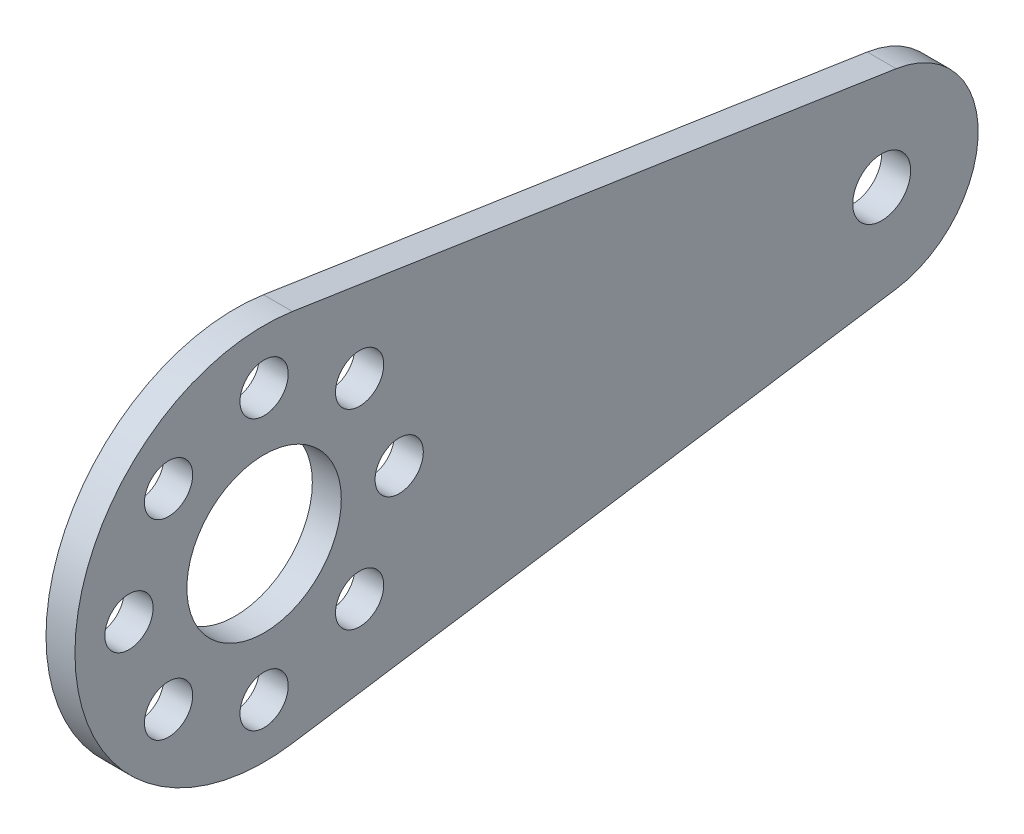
ISO-10303-21;
HEADER;
FILE_DESCRIPTION(('STEP AP214'),'2;1');
FILE_NAME('part.step','',(''),(''),'','','');
FILE_SCHEMA(('AUTOMOTIVE_DESIGN { 1 0 10303 214 1 1 1 1 }'));
ENDSEC;
DATA;
#1=APPLICATION_CONTEXT('core data for automotive mechanical design processes');
#2=APPLICATION_PROTOCOL_DEFINITION('international standard','automotive_design',2000,#1);
#3=PRODUCT_CONTEXT('',#1,'mechanical');
#4=PRODUCT('Part','Part','',(#3));
#5=PRODUCT_RELATED_PRODUCT_CATEGORY('part','',(#4));
#6=PRODUCT_DEFINITION_FORMATION('','',#4);
#7=PRODUCT_DEFINITION_CONTEXT('part definition',#1,'design');
#8=PRODUCT_DEFINITION('design','',#6,#7);
#9=PRODUCT_DEFINITION_SHAPE('','',#8);
#10=(LENGTH_UNIT() NAMED_UNIT(*) SI_UNIT(.MILLI.,.METRE.));
#11=(NAMED_UNIT(*) PLANE_ANGLE_UNIT() SI_UNIT($,.RADIAN.));
#12=(NAMED_UNIT(*) SI_UNIT($,.STERADIAN.) SOLID_ANGLE_UNIT());
#13=UNCERTAINTY_MEASURE_WITH_UNIT(LENGTH_MEASURE(1.E-05),#10,'distance_accuracy_value','');
#14=(GEOMETRIC_REPRESENTATION_CONTEXT(3) GLOBAL_UNCERTAINTY_ASSIGNED_CONTEXT((#13)) GLOBAL_UNIT_ASSIGNED_CONTEXT((#10,
#11,#12)) REPRESENTATION_CONTEXT('',''));
#15=CARTESIAN_POINT('',(0.,0.,0.));
#16=DIRECTION('',(0.,0.,1.));
#17=DIRECTION('',(1.,0.,0.));
#18=AXIS2_PLACEMENT_3D('',#15,#16,#17);
#19=CARTESIAN_POINT('',(-1.5,0.,0.));
#20=DIRECTION('',(1.,0.,0.));
#21=DIRECTION('',(0.,0.,-1.));
#22=AXIS2_PLACEMENT_3D('',#19,#20,#21);
#23=CYLINDRICAL_SURFACE('',#22,9.8);
#24=CARTESIAN_POINT('',(0.,0.,0.));
#25=DIRECTION('',(1.,0.,0.));
#26=DIRECTION('',(0.,0.,-1.));
#27=AXIS2_PLACEMENT_3D('',#24,#25,#26);
#28=CIRCLE('',#27,9.8);
#29=CARTESIAN_POINT('',(0.,9.68912276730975,-1.47));
#30=VERTEX_POINT('',#29);
#31=CARTESIAN_POINT('',(0.,-9.68912276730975,-1.47));
#32=VERTEX_POINT('',#31);
#33=EDGE_CURVE('E115',#30,#32,#28,.T.);
#34=ORIENTED_EDGE('',*,*,#33,.F.);
#35=DIRECTION('',(1.,0.,0.));
#36=VECTOR('',#35,1.);
#37=CARTESIAN_POINT('',(-1.5,9.68912276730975,-1.47));
#38=LINE('',#37,#36);
#39=CARTESIAN_POINT('',(-1.5,9.68912276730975,-1.47));
#40=VERTEX_POINT('',#39);
#41=EDGE_CURVE('E11',#40,#30,#38,.T.);
#42=ORIENTED_EDGE('',*,*,#41,.F.);
#43=CARTESIAN_POINT('',(-1.5,0.,0.));
#44=DIRECTION('',(1.,0.,0.));
#45=DIRECTION('',(0.,0.,-1.));
#46=AXIS2_PLACEMENT_3D('',#43,#44,#45);
#47=CIRCLE('',#46,9.8);
#48=CARTESIAN_POINT('',(-1.5,-9.68912276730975,-1.47));
#49=VERTEX_POINT('',#48);
#50=EDGE_CURVE('E106',#40,#49,#47,.T.);
#51=ORIENTED_EDGE('',*,*,#50,.T.);
#52=DIRECTION('',(1.,0.,0.));
#53=VECTOR('',#52,1.);
#54=CARTESIAN_POINT('',(-1.5,-9.68912276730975,-1.47));
#55=LINE('',#54,#53);
#56=EDGE_CURVE('E47',#49,#32,#55,.T.);
#57=ORIENTED_EDGE('',*,*,#56,.T.);
#58=EDGE_LOOP('',(#34,#42,#51,#57));
#59=FACE_BOUND('',#58,.T.);
#60=ADVANCED_FACE('F44',(#59),#23,.T.);
#61=CARTESIAN_POINT('',(-1.5,9.68912276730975,-1.47));
#62=DIRECTION('',(0.,0.988685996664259,-0.15));
#63=DIRECTION('',(0.,0.15,0.988685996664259));
#64=AXIS2_PLACEMENT_3D('',#61,#62,#63);
#65=PLANE('',#64);
#66=DIRECTION('',(0.,0.15,0.988685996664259));
#67=VECTOR('',#66,1.);
#68=CARTESIAN_POINT('',(0.,9.68912276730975,-1.47));
#69=LINE('',#68,#67);
#70=CARTESIAN_POINT('',(0.,4.9434299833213,-32.75));
#71=VERTEX_POINT('',#70);
#72=EDGE_CURVE('E109',#71,#30,#69,.T.);
#73=ORIENTED_EDGE('',*,*,#72,.F.);
#74=DIRECTION('',(1.,0.,0.));
#75=VECTOR('',#74,1.);
#76=CARTESIAN_POINT('',(-1.5,4.9434299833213,-32.75));
#77=LINE('',#76,#75);
#78=CARTESIAN_POINT('',(-1.5,4.9434299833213,-32.75));
#79=VERTEX_POINT('',#78);
#80=EDGE_CURVE('E54',#79,#71,#77,.T.);
#81=ORIENTED_EDGE('',*,*,#80,.F.);
#82=DIRECTION('',(0.,0.15,0.988685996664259));
#83=VECTOR('',#82,1.);
#84=CARTESIAN_POINT('',(-1.5,9.68912276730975,-1.47));
#85=LINE('',#84,#83);
#86=EDGE_CURVE('E101',#79,#40,#85,.T.);
#87=ORIENTED_EDGE('',*,*,#86,.T.);
#88=ORIENTED_EDGE('',*,*,#41,.T.);
#89=EDGE_LOOP('',(#73,#81,#87,#88));
#90=FACE_BOUND('',#89,.T.);
#91=ADVANCED_FACE('F132',(#90),#65,.T.);
#92=CARTESIAN_POINT('',(-1.5,0.,-32.));
#93=DIRECTION('',(1.,0.,0.));
#94=DIRECTION('',(0.,0.,-1.));
#95=AXIS2_PLACEMENT_3D('',#92,#93,#94);
#96=CYLINDRICAL_SURFACE('',#95,5.);
#97=CARTESIAN_POINT('',(0.,0.,-32.));
#98=DIRECTION('',(1.,0.,0.));
#99=DIRECTION('',(0.,0.,-1.));
#100=AXIS2_PLACEMENT_3D('',#97,#98,#99);
#101=CIRCLE('',#100,5.);
#102=CARTESIAN_POINT('',(0.,-4.9434299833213,-32.75));
#103=VERTEX_POINT('',#102);
#104=EDGE_CURVE('E95',#103,#71,#101,.T.);
#105=ORIENTED_EDGE('',*,*,#104,.F.);
#106=DIRECTION('',(1.,0.,0.));
#107=VECTOR('',#106,1.);
#108=CARTESIAN_POINT('',(-1.5,-4.9434299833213,-32.75));
#109=LINE('',#108,#107);
#110=CARTESIAN_POINT('',(-1.5,-4.9434299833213,-32.75));
#111=VERTEX_POINT('',#110);
#112=EDGE_CURVE('E90',#111,#103,#109,.T.);
#113=ORIENTED_EDGE('',*,*,#112,.F.);
#114=CARTESIAN_POINT('',(-1.5,0.,-32.));
#115=DIRECTION('',(1.,0.,0.));
#116=DIRECTION('',(0.,0.,-1.));
#117=AXIS2_PLACEMENT_3D('',#114,#115,#116);
#118=CIRCLE('',#117,5.);
#119=EDGE_CURVE('E93',#111,#79,#118,.T.);
#120=ORIENTED_EDGE('',*,*,#119,.T.);
#121=ORIENTED_EDGE('',*,*,#80,.T.);
#122=EDGE_LOOP('',(#105,#113,#120,#121));
#123=FACE_BOUND('',#122,.T.);
#124=ADVANCED_FACE('F92',(#123),#96,.T.);
#125=CARTESIAN_POINT('',(-1.5,-9.68912276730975,-1.47));
#126=DIRECTION('',(0.,-0.988685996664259,-0.15));
#127=DIRECTION('',(0.,0.15,-0.988685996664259));
#128=AXIS2_PLACEMENT_3D('',#125,#126,#127);
#129=PLANE('',#128);
#130=DIRECTION('',(0.,0.15,-0.988685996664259));
#131=VECTOR('',#130,1.);
#132=CARTESIAN_POINT('',(0.,-9.68912276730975,-1.47));
#133=LINE('',#132,#131);
#134=EDGE_CURVE('E119',#32,#103,#133,.T.);
#135=ORIENTED_EDGE('',*,*,#134,.F.);
#136=ORIENTED_EDGE('',*,*,#56,.F.);
#137=DIRECTION('',(0.,0.15,-0.988685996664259));
#138=VECTOR('',#137,1.);
#139=CARTESIAN_POINT('',(-1.5,-9.68912276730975,-1.47));
#140=LINE('',#139,#138);
#141=EDGE_CURVE('E100',#49,#111,#140,.T.);
#142=ORIENTED_EDGE('',*,*,#141,.T.);
#143=ORIENTED_EDGE('',*,*,#112,.T.);
#144=EDGE_LOOP('',(#135,#136,#142,#143));
#145=FACE_BOUND('',#144,.T.);
#146=ADVANCED_FACE('F104',(#145),#129,.T.);
#147=CARTESIAN_POINT('',(-1.5,0.,0.));
#148=DIRECTION('',(1.,0.,0.));
#149=DIRECTION('',(0.,0.,-1.));
#150=AXIS2_PLACEMENT_3D('',#147,#148,#149);
#151=PLANE('',#150);
#152=CARTESIAN_POINT('',(-1.5,-4.94974746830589,-4.94974746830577));
#153=DIRECTION('',(1.,0.,0.));
#154=DIRECTION('',(0.,0.,-1.));
#155=AXIS2_PLACEMENT_3D('',#152,#153,#154);
#156=CIRCLE('',#155,1.25);
#157=CARTESIAN_POINT('',(-1.5,-4.94974746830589,-6.19974746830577));
#158=VERTEX_POINT('',#157);
#159=EDGE_CURVE('E197',#158,#158,#156,.T.);
#160=ORIENTED_EDGE('',*,*,#159,.T.);
#161=EDGE_LOOP('',(#160));
#162=FACE_BOUND('',#161,.T.);
#163=CARTESIAN_POINT('',(-1.5,0.,-7.));
#164=DIRECTION('',(1.,0.,0.));
#165=DIRECTION('',(0.,0.,-1.));
#166=AXIS2_PLACEMENT_3D('',#163,#164,#165);
#167=CIRCLE('',#166,1.25);
#168=CARTESIAN_POINT('',(-1.5,0.,-8.25));
#169=VERTEX_POINT('',#168);
#170=EDGE_CURVE('E207',#169,#169,#167,.T.);
#171=ORIENTED_EDGE('',*,*,#170,.T.);
#172=EDGE_LOOP('',(#171));
#173=FACE_BOUND('',#172,.T.);
#174=CARTESIAN_POINT('',(-1.5,4.94974746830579,-4.94974746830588));
#175=DIRECTION('',(1.,0.,0.));
#176=DIRECTION('',(0.,0.,-1.));
#177=AXIS2_PLACEMENT_3D('',#174,#175,#176);
#178=CIRCLE('',#177,1.25);
#179=CARTESIAN_POINT('',(-1.5,4.94974746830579,-6.19974746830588));
#180=VERTEX_POINT('',#179);
#181=EDGE_CURVE('E215',#180,#180,#178,.T.);
#182=ORIENTED_EDGE('',*,*,#181,.T.);
#183=EDGE_LOOP('',(#182));
#184=FACE_BOUND('',#183,.T.);
#185=CARTESIAN_POINT('',(-1.5,7.,0.));
#186=DIRECTION('',(1.,0.,0.));
#187=DIRECTION('',(0.,0.,-1.));
#188=AXIS2_PLACEMENT_3D('',#185,#186,#187);
#189=CIRCLE('',#188,1.25);
#190=CARTESIAN_POINT('',(-1.5,7.,-1.25000000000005));
#191=VERTEX_POINT('',#190);
#192=EDGE_CURVE('E223',#191,#191,#189,.T.);
#193=ORIENTED_EDGE('',*,*,#192,.T.);
#194=EDGE_LOOP('',(#193));
#195=FACE_BOUND('',#194,.T.);
#196=CARTESIAN_POINT('',(-1.5,4.94974746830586,4.94974746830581));
#197=DIRECTION('',(1.,0.,0.));
#198=DIRECTION('',(0.,0.,-1.));
#199=AXIS2_PLACEMENT_3D('',#196,#197,#198);
#200=CIRCLE('',#199,1.25);
#201=CARTESIAN_POINT('',(-1.5,4.94974746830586,3.69974746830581));
#202=VERTEX_POINT('',#201);
#203=EDGE_CURVE('E231',#202,#202,#200,.T.);
#204=ORIENTED_EDGE('',*,*,#203,.T.);
#205=EDGE_LOOP('',(#204));
#206=FACE_BOUND('',#205,.T.);
#207=CARTESIAN_POINT('',(-1.5,0.,7.));
#208=DIRECTION('',(1.,0.,0.));
#209=DIRECTION('',(0.,0.,-1.));
#210=AXIS2_PLACEMENT_3D('',#207,#208,#209);
#211=CIRCLE('',#210,1.25);
#212=CARTESIAN_POINT('',(-1.5,0.,5.75));
#213=VERTEX_POINT('',#212);
#214=EDGE_CURVE('E239',#213,#213,#211,.T.);
#215=ORIENTED_EDGE('',*,*,#214,.T.);
#216=EDGE_LOOP('',(#215));
#217=FACE_BOUND('',#216,.T.);
#218=CARTESIAN_POINT('',(-1.5,-4.94974746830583,4.94974746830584));
#219=DIRECTION('',(1.,0.,0.));
#220=DIRECTION('',(0.,0.,-1.));
#221=AXIS2_PLACEMENT_3D('',#218,#219,#220);
#222=CIRCLE('',#221,1.25);
#223=CARTESIAN_POINT('',(-1.5,-4.94974746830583,3.69974746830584));
#224=VERTEX_POINT('',#223);
#225=EDGE_CURVE('E247',#224,#224,#222,.T.);
#226=ORIENTED_EDGE('',*,*,#225,.T.);
#227=EDGE_LOOP('',(#226));
#228=FACE_BOUND('',#227,.T.);
#229=CARTESIAN_POINT('',(-1.5,-7.,0.));
#230=DIRECTION('',(1.,0.,0.));
#231=DIRECTION('',(0.,0.,-1.));
#232=AXIS2_PLACEMENT_3D('',#229,#230,#231);
#233=CIRCLE('',#232,1.25);
#234=CARTESIAN_POINT('',(-1.5,-7.,-1.25));
#235=VERTEX_POINT('',#234);
#236=EDGE_CURVE('E255',#235,#235,#233,.T.);
#237=ORIENTED_EDGE('',*,*,#236,.T.);
#238=EDGE_LOOP('',(#237));
#239=FACE_BOUND('',#238,.T.);
#240=CARTESIAN_POINT('',(-1.5,0.,-32.));
#241=DIRECTION('',(1.,0.,0.));
#242=DIRECTION('',(0.,0.,-1.));
#243=AXIS2_PLACEMENT_3D('',#240,#241,#242);
#244=CIRCLE('',#243,1.5);
#245=CARTESIAN_POINT('',(-1.5,0.,-33.5));
#246=VERTEX_POINT('',#245);
#247=EDGE_CURVE('E263',#246,#246,#244,.T.);
#248=ORIENTED_EDGE('',*,*,#247,.T.);
#249=EDGE_LOOP('',(#248));
#250=FACE_BOUND('',#249,.T.);
#251=CARTESIAN_POINT('',(-1.5,0.,0.));
#252=DIRECTION('',(1.,0.,0.));
#253=DIRECTION('',(0.,0.,-1.));
#254=AXIS2_PLACEMENT_3D('',#251,#252,#253);
#255=CIRCLE('',#254,4.);
#256=CARTESIAN_POINT('',(-1.5,0.,-4.));
#257=VERTEX_POINT('',#256);
#258=EDGE_CURVE('E120',#257,#257,#255,.T.);
#259=ORIENTED_EDGE('',*,*,#258,.T.);
#260=EDGE_LOOP('',(#259));
#261=FACE_BOUND('',#260,.T.);
#262=ORIENTED_EDGE('',*,*,#50,.F.);
#263=ORIENTED_EDGE('',*,*,#86,.F.);
#264=ORIENTED_EDGE('',*,*,#119,.F.);
#265=ORIENTED_EDGE('',*,*,#141,.F.);
#266=EDGE_LOOP('',(#262,#263,#264,#265));
#267=FACE_BOUND('',#266,.T.);
#268=ADVANCED_FACE('F99',(#162,#173,#184,#195,#206,#217,#228,#239,#250,#261,#267),#151,.F.);
#269=CARTESIAN_POINT('',(0.,0.,0.));
#270=DIRECTION('',(1.,0.,0.));
#271=DIRECTION('',(0.,0.,-1.));
#272=AXIS2_PLACEMENT_3D('',#269,#270,#271);
#273=PLANE('',#272);
#274=CARTESIAN_POINT('',(0.,-4.94974746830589,-4.94974746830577));
#275=DIRECTION('',(1.,0.,0.));
#276=DIRECTION('',(0.,0.,-1.));
#277=AXIS2_PLACEMENT_3D('',#274,#275,#276);
#278=CIRCLE('',#277,1.25);
#279=CARTESIAN_POINT('',(0.,-4.94974746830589,-6.19974746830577));
#280=VERTEX_POINT('',#279);
#281=EDGE_CURVE('E200',#280,#280,#278,.T.);
#282=ORIENTED_EDGE('',*,*,#281,.F.);
#283=EDGE_LOOP('',(#282));
#284=FACE_BOUND('',#283,.T.);
#285=CARTESIAN_POINT('',(0.,0.,-7.));
#286=DIRECTION('',(1.,0.,0.));
#287=DIRECTION('',(0.,0.,-1.));
#288=AXIS2_PLACEMENT_3D('',#285,#286,#287);
#289=CIRCLE('',#288,1.25);
#290=CARTESIAN_POINT('',(0.,0.,-8.25));
#291=VERTEX_POINT('',#290);
#292=EDGE_CURVE('E204',#291,#291,#289,.T.);
#293=ORIENTED_EDGE('',*,*,#292,.F.);
#294=EDGE_LOOP('',(#293));
#295=FACE_BOUND('',#294,.T.);
#296=CARTESIAN_POINT('',(0.,4.94974746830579,-4.94974746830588));
#297=DIRECTION('',(1.,0.,0.));
#298=DIRECTION('',(0.,0.,-1.));
#299=AXIS2_PLACEMENT_3D('',#296,#297,#298);
#300=CIRCLE('',#299,1.25);
#301=CARTESIAN_POINT('',(0.,4.94974746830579,-6.19974746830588));
#302=VERTEX_POINT('',#301);
#303=EDGE_CURVE('E211',#302,#302,#300,.T.);
#304=ORIENTED_EDGE('',*,*,#303,.F.);
#305=EDGE_LOOP('',(#304));
#306=FACE_BOUND('',#305,.T.);
#307=CARTESIAN_POINT('',(0.,7.,0.));
#308=DIRECTION('',(1.,0.,0.));
#309=DIRECTION('',(0.,0.,-1.));
#310=AXIS2_PLACEMENT_3D('',#307,#308,#309);
#311=CIRCLE('',#310,1.25);
#312=CARTESIAN_POINT('',(0.,7.,-1.25000000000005));
#313=VERTEX_POINT('',#312);
#314=EDGE_CURVE('E219',#313,#313,#311,.T.);
#315=ORIENTED_EDGE('',*,*,#314,.F.);
#316=EDGE_LOOP('',(#315));
#317=FACE_BOUND('',#316,.T.);
#318=CARTESIAN_POINT('',(0.,4.94974746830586,4.94974746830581));
#319=DIRECTION('',(1.,0.,0.));
#320=DIRECTION('',(0.,0.,-1.));
#321=AXIS2_PLACEMENT_3D('',#318,#319,#320);
#322=CIRCLE('',#321,1.25);
#323=CARTESIAN_POINT('',(0.,4.94974746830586,3.69974746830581));
#324=VERTEX_POINT('',#323);
#325=EDGE_CURVE('E227',#324,#324,#322,.T.);
#326=ORIENTED_EDGE('',*,*,#325,.F.);
#327=EDGE_LOOP('',(#326));
#328=FACE_BOUND('',#327,.T.);
#329=CARTESIAN_POINT('',(0.,0.,7.));
#330=DIRECTION('',(1.,0.,0.));
#331=DIRECTION('',(0.,0.,-1.));
#332=AXIS2_PLACEMENT_3D('',#329,#330,#331);
#333=CIRCLE('',#332,1.25);
#334=CARTESIAN_POINT('',(0.,0.,5.75));
#335=VERTEX_POINT('',#334);
#336=EDGE_CURVE('E235',#335,#335,#333,.T.);
#337=ORIENTED_EDGE('',*,*,#336,.F.);
#338=EDGE_LOOP('',(#337));
#339=FACE_BOUND('',#338,.T.);
#340=CARTESIAN_POINT('',(0.,-4.94974746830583,4.94974746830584));
#341=DIRECTION('',(1.,0.,0.));
#342=DIRECTION('',(0.,0.,-1.));
#343=AXIS2_PLACEMENT_3D('',#340,#341,#342);
#344=CIRCLE('',#343,1.25);
#345=CARTESIAN_POINT('',(0.,-4.94974746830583,3.69974746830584));
#346=VERTEX_POINT('',#345);
#347=EDGE_CURVE('E243',#346,#346,#344,.T.);
#348=ORIENTED_EDGE('',*,*,#347,.F.);
#349=EDGE_LOOP('',(#348));
#350=FACE_BOUND('',#349,.T.);
#351=CARTESIAN_POINT('',(0.,-7.,0.));
#352=DIRECTION('',(1.,0.,0.));
#353=DIRECTION('',(0.,0.,-1.));
#354=AXIS2_PLACEMENT_3D('',#351,#352,#353);
#355=CIRCLE('',#354,1.25);
#356=CARTESIAN_POINT('',(0.,-7.,-1.25));
#357=VERTEX_POINT('',#356);
#358=EDGE_CURVE('E251',#357,#357,#355,.T.);
#359=ORIENTED_EDGE('',*,*,#358,.F.);
#360=EDGE_LOOP('',(#359));
#361=FACE_BOUND('',#360,.T.);
#362=CARTESIAN_POINT('',(0.,0.,-32.));
#363=DIRECTION('',(1.,0.,0.));
#364=DIRECTION('',(0.,0.,-1.));
#365=AXIS2_PLACEMENT_3D('',#362,#363,#364);
#366=CIRCLE('',#365,1.5);
#367=CARTESIAN_POINT('',(0.,0.,-33.5));
#368=VERTEX_POINT('',#367);
#369=EDGE_CURVE('E259',#368,#368,#366,.T.);
#370=ORIENTED_EDGE('',*,*,#369,.F.);
#371=EDGE_LOOP('',(#370));
#372=FACE_BOUND('',#371,.T.);
#373=CARTESIAN_POINT('',(0.,0.,0.));
#374=DIRECTION('',(1.,0.,0.));
#375=DIRECTION('',(0.,0.,-1.));
#376=AXIS2_PLACEMENT_3D('',#373,#374,#375);
#377=CIRCLE('',#376,4.);
#378=CARTESIAN_POINT('',(0.,0.,-4.));
#379=VERTEX_POINT('',#378);
#380=EDGE_CURVE('E267',#379,#379,#377,.T.);
#381=ORIENTED_EDGE('',*,*,#380,.F.);
#382=EDGE_LOOP('',(#381));
#383=FACE_BOUND('',#382,.T.);
#384=ORIENTED_EDGE('',*,*,#33,.T.);
#385=ORIENTED_EDGE('',*,*,#134,.T.);
#386=ORIENTED_EDGE('',*,*,#104,.T.);
#387=ORIENTED_EDGE('',*,*,#72,.T.);
#388=EDGE_LOOP('',(#384,#385,#386,#387));
#389=FACE_BOUND('',#388,.T.);
#390=ADVANCED_FACE('F131',(#284,#295,#306,#317,#328,#339,#350,#361,#372,#383,#389),#273,.T.);
#391=CARTESIAN_POINT('',(-1.5,0.,0.));
#392=DIRECTION('',(1.,0.,0.));
#393=DIRECTION('',(0.,0.,-1.));
#394=AXIS2_PLACEMENT_3D('',#391,#392,#393);
#395=CYLINDRICAL_SURFACE('',#394,4.);
#396=ORIENTED_EDGE('',*,*,#258,.F.);
#397=EDGE_LOOP('',(#396));
#398=FACE_BOUND('',#397,.T.);
#399=ORIENTED_EDGE('',*,*,#380,.T.);
#400=EDGE_LOOP('',(#399));
#401=FACE_BOUND('',#400,.T.);
#402=ADVANCED_FACE('F150',(#398,#401),#395,.F.);
#403=CARTESIAN_POINT('',(-1.5,0.,-32.));
#404=DIRECTION('',(1.,0.,0.));
#405=DIRECTION('',(0.,0.,-1.));
#406=AXIS2_PLACEMENT_3D('',#403,#404,#405);
#407=CYLINDRICAL_SURFACE('',#406,1.5);
#408=ORIENTED_EDGE('',*,*,#247,.F.);
#409=EDGE_LOOP('',(#408));
#410=FACE_BOUND('',#409,.T.);
#411=ORIENTED_EDGE('',*,*,#369,.T.);
#412=EDGE_LOOP('',(#411));
#413=FACE_BOUND('',#412,.T.);
#414=ADVANCED_FACE('F157',(#410,#413),#407,.F.);
#415=CARTESIAN_POINT('',(-1.5,-7.,0.));
#416=DIRECTION('',(1.,0.,0.));
#417=DIRECTION('',(0.,0.,-1.));
#418=AXIS2_PLACEMENT_3D('',#415,#416,#417);
#419=CYLINDRICAL_SURFACE('',#418,1.25);
#420=ORIENTED_EDGE('',*,*,#236,.F.);
#421=EDGE_LOOP('',(#420));
#422=FACE_BOUND('',#421,.T.);
#423=ORIENTED_EDGE('',*,*,#358,.T.);
#424=EDGE_LOOP('',(#423));
#425=FACE_BOUND('',#424,.T.);
#426=ADVANCED_FACE('F161',(#422,#425),#419,.F.);
#427=CARTESIAN_POINT('',(-1.5,-4.94974746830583,4.94974746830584));
#428=DIRECTION('',(1.,0.,0.));
#429=DIRECTION('',(0.,0.,-1.));
#430=AXIS2_PLACEMENT_3D('',#427,#428,#429);
#431=CYLINDRICAL_SURFACE('',#430,1.25);
#432=ORIENTED_EDGE('',*,*,#225,.F.);
#433=EDGE_LOOP('',(#432));
#434=FACE_BOUND('',#433,.T.);
#435=ORIENTED_EDGE('',*,*,#347,.T.);
#436=EDGE_LOOP('',(#435));
#437=FACE_BOUND('',#436,.T.);
#438=ADVANCED_FACE('F165',(#434,#437),#431,.F.);
#439=CARTESIAN_POINT('',(-1.5,0.,7.));
#440=DIRECTION('',(1.,0.,0.));
#441=DIRECTION('',(0.,0.,-1.));
#442=AXIS2_PLACEMENT_3D('',#439,#440,#441);
#443=CYLINDRICAL_SURFACE('',#442,1.25);
#444=ORIENTED_EDGE('',*,*,#214,.F.);
#445=EDGE_LOOP('',(#444));
#446=FACE_BOUND('',#445,.T.);
#447=ORIENTED_EDGE('',*,*,#336,.T.);
#448=EDGE_LOOP('',(#447));
#449=FACE_BOUND('',#448,.T.);
#450=ADVANCED_FACE('F169',(#446,#449),#443,.F.);
#451=CARTESIAN_POINT('',(-1.5,4.94974746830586,4.94974746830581));
#452=DIRECTION('',(1.,0.,0.));
#453=DIRECTION('',(0.,0.,-1.));
#454=AXIS2_PLACEMENT_3D('',#451,#452,#453);
#455=CYLINDRICAL_SURFACE('',#454,1.25);
#456=ORIENTED_EDGE('',*,*,#203,.F.);
#457=EDGE_LOOP('',(#456));
#458=FACE_BOUND('',#457,.T.);
#459=ORIENTED_EDGE('',*,*,#325,.T.);
#460=EDGE_LOOP('',(#459));
#461=FACE_BOUND('',#460,.T.);
#462=ADVANCED_FACE('F173',(#458,#461),#455,.F.);
#463=CARTESIAN_POINT('',(-1.5,7.,0.));
#464=DIRECTION('',(1.,0.,0.));
#465=DIRECTION('',(0.,0.,-1.));
#466=AXIS2_PLACEMENT_3D('',#463,#464,#465);
#467=CYLINDRICAL_SURFACE('',#466,1.25);
#468=ORIENTED_EDGE('',*,*,#192,.F.);
#469=EDGE_LOOP('',(#468));
#470=FACE_BOUND('',#469,.T.);
#471=ORIENTED_EDGE('',*,*,#314,.T.);
#472=EDGE_LOOP('',(#471));
#473=FACE_BOUND('',#472,.T.);
#474=ADVANCED_FACE('F177',(#470,#473),#467,.F.);
#475=CARTESIAN_POINT('',(-1.5,4.94974746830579,-4.94974746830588));
#476=DIRECTION('',(1.,0.,0.));
#477=DIRECTION('',(0.,0.,-1.));
#478=AXIS2_PLACEMENT_3D('',#475,#476,#477);
#479=CYLINDRICAL_SURFACE('',#478,1.25);
#480=ORIENTED_EDGE('',*,*,#181,.F.);
#481=EDGE_LOOP('',(#480));
#482=FACE_BOUND('',#481,.T.);
#483=ORIENTED_EDGE('',*,*,#303,.T.);
#484=EDGE_LOOP('',(#483));
#485=FACE_BOUND('',#484,.T.);
#486=ADVANCED_FACE('F181',(#482,#485),#479,.F.);
#487=CARTESIAN_POINT('',(-1.5,0.,-7.));
#488=DIRECTION('',(1.,0.,0.));
#489=DIRECTION('',(0.,0.,-1.));
#490=AXIS2_PLACEMENT_3D('',#487,#488,#489);
#491=CYLINDRICAL_SURFACE('',#490,1.25);
#492=ORIENTED_EDGE('',*,*,#170,.F.);
#493=EDGE_LOOP('',(#492));
#494=FACE_BOUND('',#493,.T.);
#495=ORIENTED_EDGE('',*,*,#292,.T.);
#496=EDGE_LOOP('',(#495));
#497=FACE_BOUND('',#496,.T.);
#498=ADVANCED_FACE('F185',(#494,#497),#491,.F.);
#499=CARTESIAN_POINT('',(-1.5,-4.94974746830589,-4.94974746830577));
#500=DIRECTION('',(1.,0.,0.));
#501=DIRECTION('',(0.,0.,-1.));
#502=AXIS2_PLACEMENT_3D('',#499,#500,#501);
#503=CYLINDRICAL_SURFACE('',#502,1.25);
#504=ORIENTED_EDGE('',*,*,#159,.F.);
#505=EDGE_LOOP('',(#504));
#506=FACE_BOUND('',#505,.T.);
#507=ORIENTED_EDGE('',*,*,#281,.T.);
#508=EDGE_LOOP('',(#507));
#509=FACE_BOUND('',#508,.T.);
#510=ADVANCED_FACE('F189',(#506,#509),#503,.F.);
#511=CLOSED_SHELL('',(#60,#91,#124,#146,#268,#390,#402,#414,#426,#438,#450,#462,#474,#486,#498,#510));
#512=MANIFOLD_SOLID_BREP('B2',#511);
#513=ADVANCED_BREP_SHAPE_REPRESENTATION('',(#18,#512),#14);
#514=SHAPE_DEFINITION_REPRESENTATION(#9,#513);
ENDSEC;
END-ISO-10303-21;
